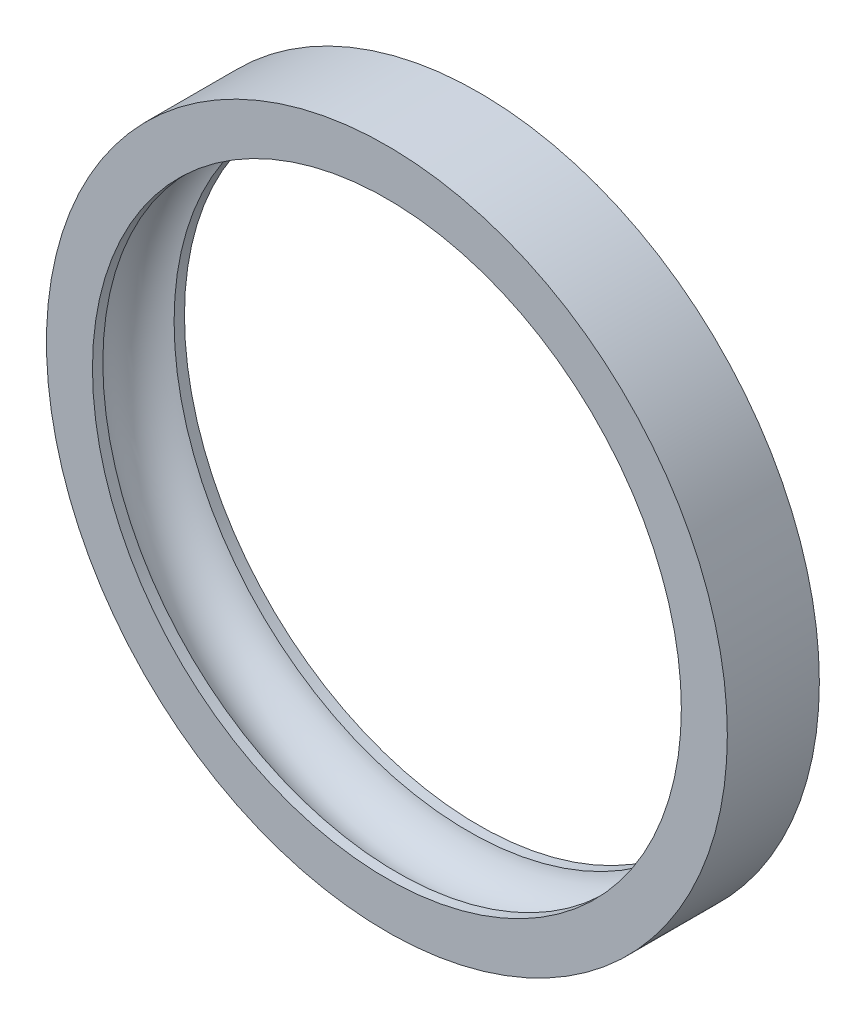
from build123d import *

# Parameters (mm, degrees)
SKETCH_1_R          = 37
EXTRUDE_5_DEPTH     = 10
SKETCH_2_R          = 32
CUT_EXTRUDE_9_DEPTH = 10


with BuildPart() as part:
    # Sketch 1 → Extrude 5 (new body)
    with BuildSketch(Plane.XY):
        Circle(SKETCH_1_R)
    extrude(amount=EXTRUDE_5_DEPTH)

    # Sketch 2 → Cut-Extrude 9 (cut)
    with BuildSketch(Plane.XY):
        Circle(SKETCH_2_R)
    extrude(amount=CUT_EXTRUDE_9_DEPTH, mode=Mode.SUBTRACT)

    # Sketch 8 → Cut-Revolve 4 (revolve, cut)
    with BuildSketch(Plane(origin=(0, 0, 0), x_dir=(0, 0, -1), z_dir=(1, 0, 0)), mode=Mode.PRIVATE) as cut_revolve_4_sk:
        with BuildLine():
            Line((-1.127016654, 32), (-8.872983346, 32))
            ThreePointArc((-8.872983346, 32), (-5, 35), (-1.127016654, 32))
        make_face()
    revolve(cut_revolve_4_sk.sketch.rotate(Axis((0, 0, 0), (0, 0, 1)), 90), axis=Axis((0, 0, 0), (0, 0, 1)), mode=Mode.SUBTRACT)


solid = part.part
